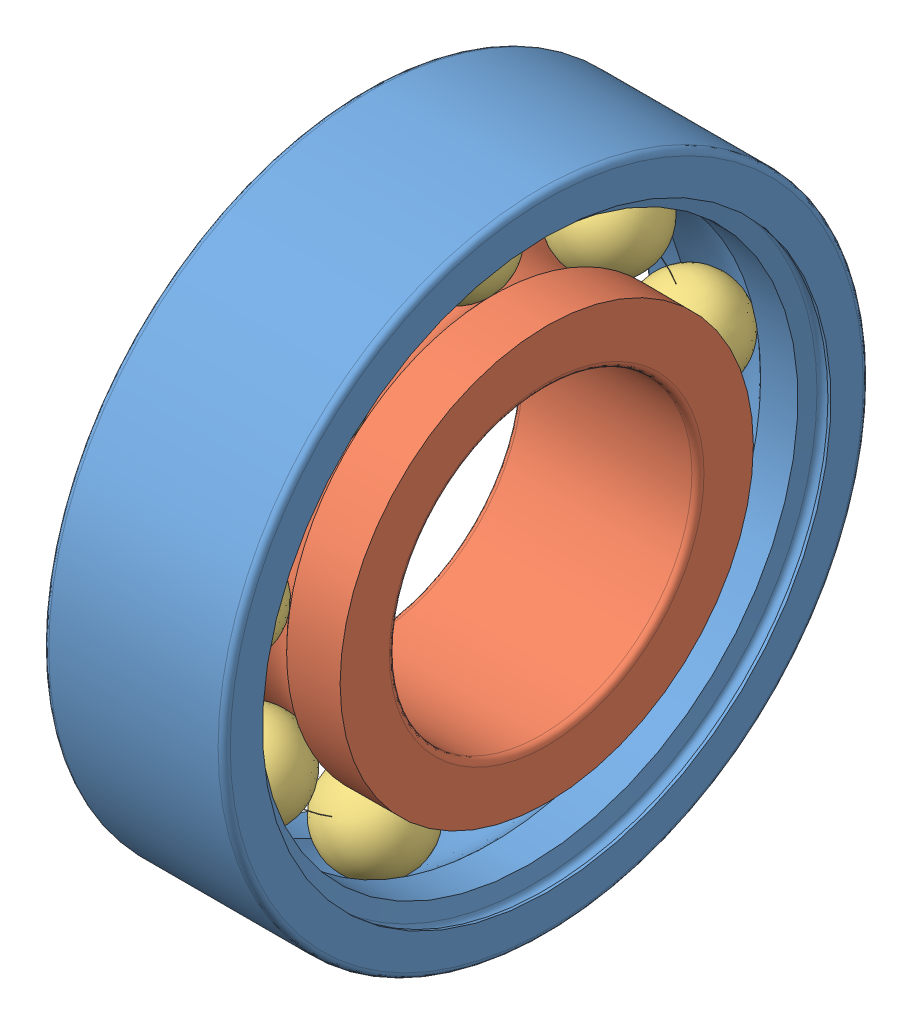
SolidWorks assembly bearing_6002_2.SLDASM, configuration Default (file format 8000). Lengths in mm.
Overall size (9 32 32).
3 component instances, 3 part files, 0 mates.
Components (placement in the parent):
- bearing_6002_2_01-1: bearing_6002_2_01.SLDPRT [Default] at origin size (9 32 32)
- bearing_6002_2_02-1: bearing_6002_2_02.SLDPRT [Default] at origin size (9 20.5 20.5)
- bearing_6002_2_03-1: bearing_6002_2_03.SLDPRT [Default] at origin size (4.76 27.55 27.9)
